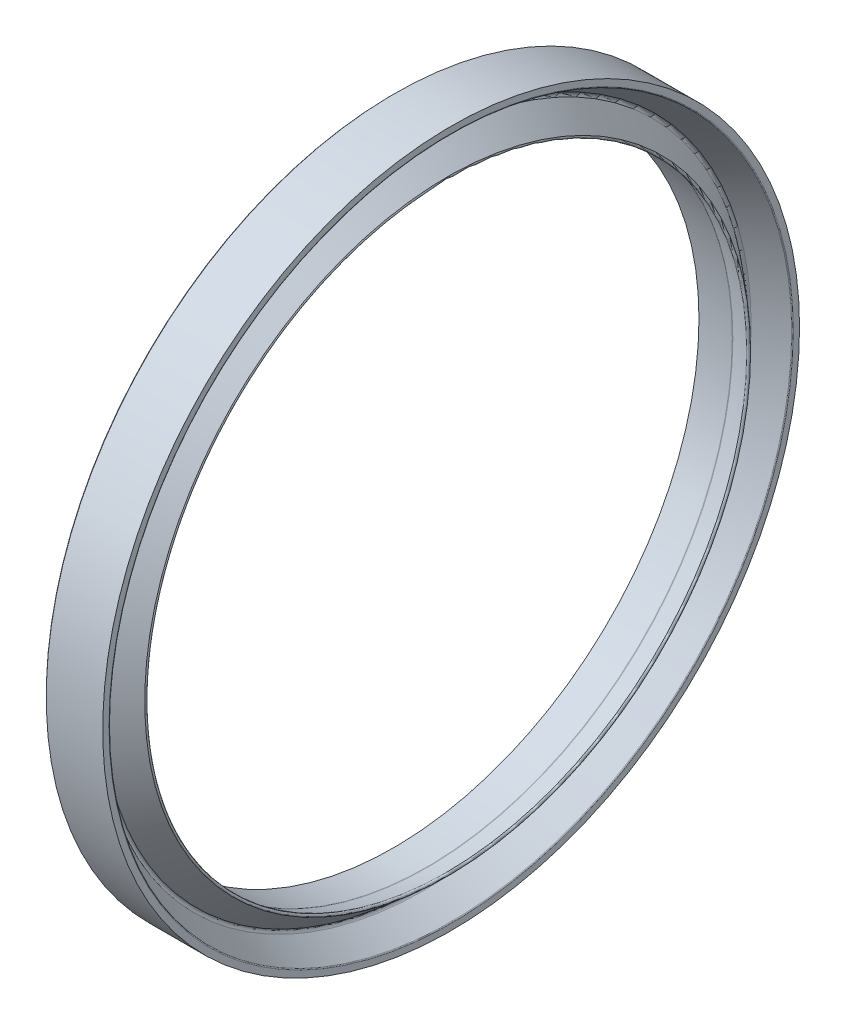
from build123d import *

# Parameters (mm, degrees)
ECHELLE1_SCALE = 0.5


with BuildPart() as part:
    # Esquisse1 → Base-R_volution (revolve)
    with BuildSketch(Plane(origin=(0, 0, 0), x_dir=(-1, 0, 0), z_dir=(0, 0, 1)), mode=Mode.PRIVATE) as base_r_volution_sk:
        with BuildLine():
            Line((9.4, 58), (9.6, 57.8))
            Line((9.6, 57.8), (9.6, 50.857437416))
            Line((9.6, 50.857437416), (4.052660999, 50.857437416))
            ThreePointArc((4.052660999, 50.857437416), (4.000450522, 50.85401536), (3.949133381, 50.843807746))
            Line((3.949133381, 50.843807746), (0.8, 50))
            ThreePointArc((0.8, 50), (0.516618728, 50.124690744), (0.57701887, 50.428342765))
            Line((0.57701887, 50.428342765), (4.436003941, 53.666415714))
            ThreePointArc((4.436003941, 53.666415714), (4.577366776, 54.007695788), (4.378888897, 54.319243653))
            Line((4.378888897, 54.319243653), (0.1, 56.789661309))
            ThreePointArc((0.1, 56.789661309), (0.026794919, 56.86286639), (0, 56.96286639))
            Line((0, 56.96286639), (0, 58))
            Line((0, 58), (9.4, 58))
        make_face()
    revolve(base_r_volution_sk.sketch.rotate(Axis((2.43404063, 0, 0), (-1, 0, 0)), 270), axis=Axis((2.43404063, 0, 0), (-1, 0, 0)))


with BuildPart() as part_1:
    # Echelle1: scaled about (-5.65874761, 0, 0)
    add(part.part.scale(ECHELLE1_SCALE).moved(Location((-2.829373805, 0, 0))))


solid = part_1.part
